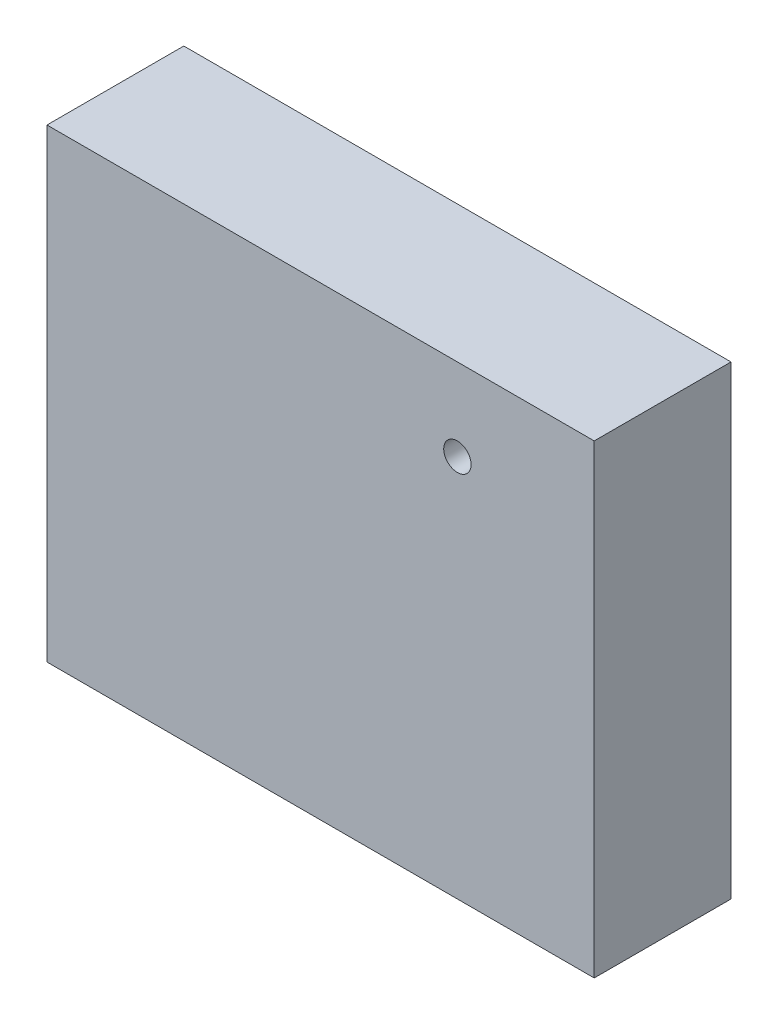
ISO-10303-21;
HEADER;
FILE_DESCRIPTION(('STEP AP214'),'2;1');
FILE_NAME('part.step','',(''),(''),'','','');
FILE_SCHEMA(('AUTOMOTIVE_DESIGN { 1 0 10303 214 1 1 1 1 }'));
ENDSEC;
DATA;
#1=APPLICATION_CONTEXT('core data for automotive mechanical design processes');
#2=APPLICATION_PROTOCOL_DEFINITION('international standard','automotive_design',2000,#1);
#3=PRODUCT_CONTEXT('',#1,'mechanical');
#4=PRODUCT('Part','Part','',(#3));
#5=PRODUCT_RELATED_PRODUCT_CATEGORY('part','',(#4));
#6=PRODUCT_DEFINITION_FORMATION('','',#4);
#7=PRODUCT_DEFINITION_CONTEXT('part definition',#1,'design');
#8=PRODUCT_DEFINITION('design','',#6,#7);
#9=PRODUCT_DEFINITION_SHAPE('','',#8);
#10=(LENGTH_UNIT() NAMED_UNIT(*) SI_UNIT(.MILLI.,.METRE.));
#11=(NAMED_UNIT(*) PLANE_ANGLE_UNIT() SI_UNIT($,.RADIAN.));
#12=(NAMED_UNIT(*) SI_UNIT($,.STERADIAN.) SOLID_ANGLE_UNIT());
#13=UNCERTAINTY_MEASURE_WITH_UNIT(LENGTH_MEASURE(1.E-05),#10,'distance_accuracy_value','');
#14=(GEOMETRIC_REPRESENTATION_CONTEXT(3) GLOBAL_UNCERTAINTY_ASSIGNED_CONTEXT((#13)) GLOBAL_UNIT_ASSIGNED_CONTEXT((#10,
#11,#12)) REPRESENTATION_CONTEXT('',''));
#15=CARTESIAN_POINT('',(0.,0.,0.));
#16=DIRECTION('',(0.,0.,1.));
#17=DIRECTION('',(1.,0.,0.));
#18=AXIS2_PLACEMENT_3D('',#15,#16,#17);
#19=CARTESIAN_POINT('',(150.,0.,50.));
#20=DIRECTION('',(-1.,0.,0.));
#21=DIRECTION('',(0.,0.,1.));
#22=AXIS2_PLACEMENT_3D('',#19,#20,#21);
#23=PLANE('',#22);
#24=DIRECTION('',(0.,1.,0.));
#25=VECTOR('',#24,1.);
#26=CARTESIAN_POINT('',(150.,0.,0.));
#27=LINE('',#26,#25);
#28=CARTESIAN_POINT('',(150.,-20.,0.));
#29=VERTEX_POINT('',#28);
#30=CARTESIAN_POINT('',(150.,150.,0.));
#31=VERTEX_POINT('',#30);
#32=EDGE_CURVE('E60',#29,#31,#27,.T.);
#33=ORIENTED_EDGE('',*,*,#32,.T.);
#34=DIRECTION('',(0.,0.,-1.));
#35=VECTOR('',#34,1.);
#36=CARTESIAN_POINT('',(150.,150.,50.));
#37=LINE('',#36,#35);
#38=CARTESIAN_POINT('',(150.,150.,50.));
#39=VERTEX_POINT('',#38);
#40=EDGE_CURVE('E11',#39,#31,#37,.T.);
#41=ORIENTED_EDGE('',*,*,#40,.F.);
#42=DIRECTION('',(0.,1.,0.));
#43=VECTOR('',#42,1.);
#44=CARTESIAN_POINT('',(150.,0.,50.));
#45=LINE('',#44,#43);
#46=CARTESIAN_POINT('',(150.,-20.,50.));
#47=VERTEX_POINT('',#46);
#48=EDGE_CURVE('E85',#47,#39,#45,.T.);
#49=ORIENTED_EDGE('',*,*,#48,.F.);
#50=DIRECTION('',(0.,0.,1.));
#51=VECTOR('',#50,1.);
#52=CARTESIAN_POINT('',(150.,-20.,50.));
#53=LINE('',#52,#51);
#54=EDGE_CURVE('E93',#29,#47,#53,.T.);
#55=ORIENTED_EDGE('',*,*,#54,.F.);
#56=EDGE_LOOP('',(#33,#41,#49,#55));
#57=FACE_BOUND('',#56,.T.);
#58=ADVANCED_FACE('F33',(#57),#23,.F.);
#59=CARTESIAN_POINT('',(150.,150.,50.));
#60=DIRECTION('',(0.,-1.,0.));
#61=DIRECTION('',(1.,0.,0.));
#62=AXIS2_PLACEMENT_3D('',#59,#60,#61);
#63=PLANE('',#62);
#64=DIRECTION('',(-1.,0.,0.));
#65=VECTOR('',#64,1.);
#66=CARTESIAN_POINT('',(150.,150.,0.));
#67=LINE('',#66,#65);
#68=CARTESIAN_POINT('',(-50.,150.,0.));
#69=VERTEX_POINT('',#68);
#70=EDGE_CURVE('E86',#31,#69,#67,.T.);
#71=ORIENTED_EDGE('',*,*,#70,.T.);
#72=DIRECTION('',(0.,0.,-1.));
#73=VECTOR('',#72,1.);
#74=CARTESIAN_POINT('',(-50.,150.,50.));
#75=LINE('',#74,#73);
#76=CARTESIAN_POINT('',(-50.,150.,50.));
#77=VERTEX_POINT('',#76);
#78=EDGE_CURVE('E41',#77,#69,#75,.T.);
#79=ORIENTED_EDGE('',*,*,#78,.F.);
#80=DIRECTION('',(-1.,0.,0.));
#81=VECTOR('',#80,1.);
#82=CARTESIAN_POINT('',(150.,150.,50.));
#83=LINE('',#82,#81);
#84=EDGE_CURVE('E49',#39,#77,#83,.T.);
#85=ORIENTED_EDGE('',*,*,#84,.F.);
#86=ORIENTED_EDGE('',*,*,#40,.T.);
#87=EDGE_LOOP('',(#71,#79,#85,#86));
#88=FACE_BOUND('',#87,.T.);
#89=ADVANCED_FACE('F112',(#88),#63,.F.);
#90=CARTESIAN_POINT('',(-50.,150.,50.));
#91=DIRECTION('',(1.,0.,0.));
#92=DIRECTION('',(0.,1.,0.));
#93=AXIS2_PLACEMENT_3D('',#90,#91,#92);
#94=PLANE('',#93);
#95=DIRECTION('',(0.,-1.,0.));
#96=VECTOR('',#95,1.);
#97=CARTESIAN_POINT('',(-50.,150.,0.));
#98=LINE('',#97,#96);
#99=CARTESIAN_POINT('',(-50.,-20.,0.));
#100=VERTEX_POINT('',#99);
#101=EDGE_CURVE('E78',#69,#100,#98,.T.);
#102=ORIENTED_EDGE('',*,*,#101,.T.);
#103=DIRECTION('',(0.,0.,-1.));
#104=VECTOR('',#103,1.);
#105=CARTESIAN_POINT('',(-50.,-20.,50.));
#106=LINE('',#105,#104);
#107=CARTESIAN_POINT('',(-50.,-20.,50.));
#108=VERTEX_POINT('',#107);
#109=EDGE_CURVE('E82',#108,#100,#106,.T.);
#110=ORIENTED_EDGE('',*,*,#109,.F.);
#111=DIRECTION('',(0.,-1.,0.));
#112=VECTOR('',#111,1.);
#113=CARTESIAN_POINT('',(-50.,150.,50.));
#114=LINE('',#113,#112);
#115=EDGE_CURVE('E65',#77,#108,#114,.T.);
#116=ORIENTED_EDGE('',*,*,#115,.F.);
#117=ORIENTED_EDGE('',*,*,#78,.T.);
#118=EDGE_LOOP('',(#102,#110,#116,#117));
#119=FACE_BOUND('',#118,.T.);
#120=ADVANCED_FACE('F80',(#119),#94,.F.);
#121=CARTESIAN_POINT('',(0.,0.,50.));
#122=DIRECTION('',(0.,0.,1.));
#123=DIRECTION('',(1.,0.,0.));
#124=AXIS2_PLACEMENT_3D('',#121,#122,#123);
#125=PLANE('',#124);
#126=CARTESIAN_POINT('',(100.,120.,50.));
#127=DIRECTION('',(0.,0.,1.));
#128=DIRECTION('',(1.,0.,0.));
#129=AXIS2_PLACEMENT_3D('',#126,#127,#128);
#130=CIRCLE('',#129,5.00000000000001);
#131=CARTESIAN_POINT('',(105.,120.,50.));
#132=VERTEX_POINT('',#131);
#133=EDGE_CURVE('E101',#132,#132,#130,.T.);
#134=ORIENTED_EDGE('',*,*,#133,.F.);
#135=EDGE_LOOP('',(#134));
#136=FACE_BOUND('',#135,.T.);
#137=ORIENTED_EDGE('',*,*,#115,.T.);
#138=DIRECTION('',(-1.,0.,0.));
#139=VECTOR('',#138,1.);
#140=CARTESIAN_POINT('',(-50.,-20.,50.));
#141=LINE('',#140,#139);
#142=EDGE_CURVE('E96',#47,#108,#141,.T.);
#143=ORIENTED_EDGE('',*,*,#142,.F.);
#144=ORIENTED_EDGE('',*,*,#48,.T.);
#145=ORIENTED_EDGE('',*,*,#84,.T.);
#146=EDGE_LOOP('',(#137,#143,#144,#145));
#147=FACE_BOUND('',#146,.T.);
#148=ADVANCED_FACE('F113',(#136,#147),#125,.T.);
#149=CARTESIAN_POINT('',(0.,0.,0.));
#150=DIRECTION('',(0.,0.,1.));
#151=DIRECTION('',(1.,0.,0.));
#152=AXIS2_PLACEMENT_3D('',#149,#150,#151);
#153=PLANE('',#152);
#154=CARTESIAN_POINT('',(100.,120.,0.));
#155=DIRECTION('',(0.,0.,1.));
#156=DIRECTION('',(1.,0.,0.));
#157=AXIS2_PLACEMENT_3D('',#154,#155,#156);
#158=CIRCLE('',#157,5.00000000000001);
#159=CARTESIAN_POINT('',(105.,120.,0.));
#160=VERTEX_POINT('',#159);
#161=EDGE_CURVE('E102',#160,#160,#158,.T.);
#162=ORIENTED_EDGE('',*,*,#161,.T.);
#163=EDGE_LOOP('',(#162));
#164=FACE_BOUND('',#163,.T.);
#165=ORIENTED_EDGE('',*,*,#32,.F.);
#166=DIRECTION('',(1.,0.,0.));
#167=VECTOR('',#166,1.);
#168=CARTESIAN_POINT('',(-50.,-20.,0.));
#169=LINE('',#168,#167);
#170=EDGE_CURVE('E89',#100,#29,#169,.T.);
#171=ORIENTED_EDGE('',*,*,#170,.F.);
#172=ORIENTED_EDGE('',*,*,#101,.F.);
#173=ORIENTED_EDGE('',*,*,#70,.F.);
#174=EDGE_LOOP('',(#165,#171,#172,#173));
#175=FACE_BOUND('',#174,.T.);
#176=ADVANCED_FACE('F90',(#164,#175),#153,.F.);
#177=CARTESIAN_POINT('',(100.,120.,0.));
#178=DIRECTION('',(0.,0.,1.));
#179=DIRECTION('',(1.,0.,0.));
#180=AXIS2_PLACEMENT_3D('',#177,#178,#179);
#181=CYLINDRICAL_SURFACE('',#180,5.00000000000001);
#182=ORIENTED_EDGE('',*,*,#161,.F.);
#183=EDGE_LOOP('',(#182));
#184=FACE_BOUND('',#183,.T.);
#185=ORIENTED_EDGE('',*,*,#133,.T.);
#186=EDGE_LOOP('',(#185));
#187=FACE_BOUND('',#186,.T.);
#188=ADVANCED_FACE('F121',(#184,#187),#181,.F.);
#189=CARTESIAN_POINT('',(0.,-20.,0.));
#190=DIRECTION('',(0.,-1.,0.));
#191=DIRECTION('',(0.,0.,-1.));
#192=AXIS2_PLACEMENT_3D('',#189,#190,#191);
#193=PLANE('',#192);
#194=ORIENTED_EDGE('',*,*,#109,.T.);
#195=ORIENTED_EDGE('',*,*,#170,.T.);
#196=ORIENTED_EDGE('',*,*,#54,.T.);
#197=ORIENTED_EDGE('',*,*,#142,.T.);
#198=EDGE_LOOP('',(#194,#195,#196,#197));
#199=FACE_BOUND('',#198,.T.);
#200=ADVANCED_FACE('F95',(#199),#193,.T.);
#201=CLOSED_SHELL('',(#58,#89,#120,#148,#176,#188,#200));
#202=MANIFOLD_SOLID_BREP('B2',#201);
#203=ADVANCED_BREP_SHAPE_REPRESENTATION('',(#18,#202),#14);
#204=SHAPE_DEFINITION_REPRESENTATION(#9,#203);
ENDSEC;
END-ISO-10303-21;
